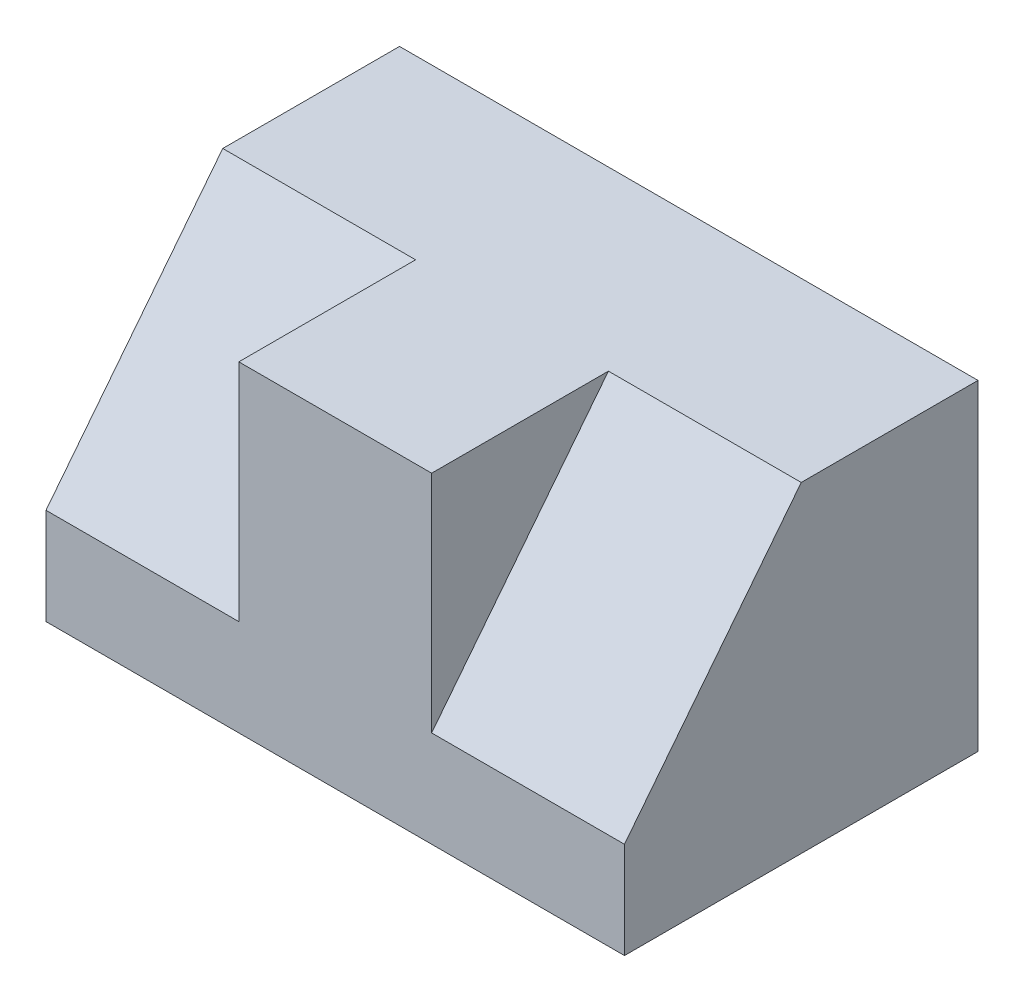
from build123d import *

# Parameters (mm, degrees)
SKETCH_1_W          = 90
SKETCH_1_H          = 55
EXTRUDE_1_DEPTH     = 50
CUT_EXTRUDE_1_DEPTH = 30
CUT_EXTRUDE_2_DEPTH = 30


with BuildPart() as part:
    # Sketch 1 → Extrude 1 (new body)
    with BuildSketch(Plane(origin=(0, 0, 0), x_dir=(1, 0, 0), z_dir=(0, 1, 0))):
        with Locations((45, 27.5)):
            Rectangle(SKETCH_1_W, SKETCH_1_H)
    extrude(amount=EXTRUDE_1_DEPTH)

    # Sketch 2 → Cut-Extrude 1 (cut)
    with BuildSketch(Plane(origin=(90, 0, 0), x_dir=(0, 0, -1), z_dir=(1, 0, 0))):
        Polygon((0, 50), (27.5, 50), (0, 15), align=None)
    extrude(amount=-CUT_EXTRUDE_1_DEPTH, mode=Mode.SUBTRACT)

    # Sketch 3 → Cut-Extrude 2 (cut)
    with BuildSketch(Plane.ZY):
        Polygon((-27.5, 50), (0, 50), (0, 15), align=None)
    extrude(amount=-CUT_EXTRUDE_2_DEPTH, mode=Mode.SUBTRACT)


solid = part.part
